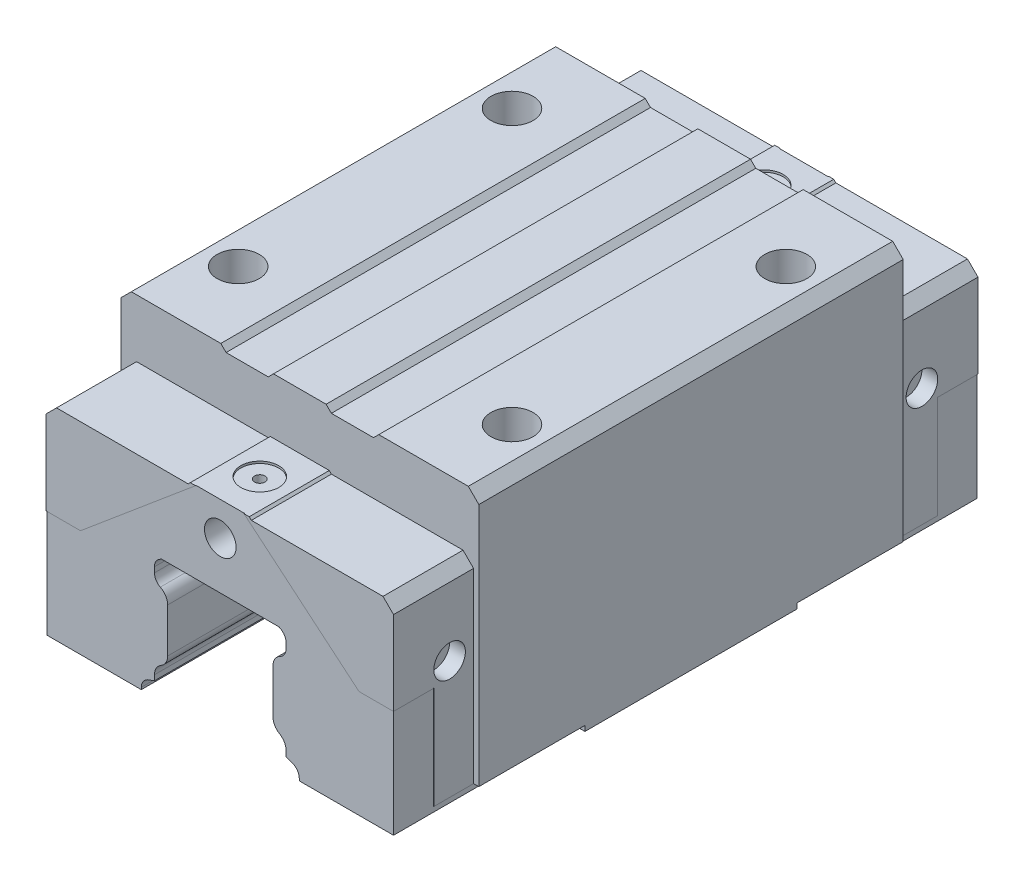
from build123d import *

# Parameters (mm, degrees)
BOSS_EXTRUDE1_DEPTH     = 27.75
CUT_EXTRUDE1_DEPTH      = 7.6
SKETCH8_W               = 6.5
SKETCH8_H               = 1.5
CUT_EXTRUDE5_DEPTH      = 0.05
SKETCH14_W              = 3.775
SKETCH14_H              = 10.233974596
CUT_EXTRUDE6_DEPTH      = 0.05
SKETCH11_R              = 1.5
CUT_EXTRUDE4_DEPTH      = 1.5
MIRROR1_COPY_1_SKETCH_W = 3.775
MIRROR1_COPY_1_SKETCH_H = 10.233974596
MIRROR1_COPY_1_DEPTH    = 0.05
MIRROR1_COPY_2_SKETCH_R = 1.5
MIRROR1_COPY_2_DEPTH    = 1.5
CUT_EXTRUDE2_START      = 10.075
SKETCH10_W              = 0.55
SKETCH10_H              = 0.5
CUT_EXTRUDE2_DEPTH      = 31.780262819
CUT_EXTRUDE3_START      = -10.075
SKETCH10_2_W            = 0.55
SKETCH10_2_H            = 0.5
CUT_EXTRUDE3_DEPTH      = 31.780262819
SKETCH15_W              = 40.3
SKETCH15_H              = 17.7
M_CUT_EXTRUDE7_DEPTH    = 0.5
SKETCH18_R              = 2
M_HOLE_DEPTH            = 7


with BuildPart() as part:
    # Sketch2 → Boss-Extrude1 (new, symmetric)
    with BuildSketch(Plane.XY):
        with BuildLine():
            Line((5.576794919, 11.7), (-5.576794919, 11.7))
            Line((-5.576794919, 11.7), (-5.75, 11.6))
            ThreePointArc((-5.75, 11.6), (-6.116025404, 11.233974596), (-6.25, 10.733974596))
            Line((-6.25, 10.733974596), (-6.25, 10.233974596))
            ThreePointArc((-6.25, 10.233974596), (-6.099836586, 9.70692832), (-5.694444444, 9.33816818))
            ThreePointArc((-5.694444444, 9.33816818), (-5.187704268, 8.877218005), (-5, 8.218410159))
            Line((-5, 8.218410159), (-5, 4.020233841))
            ThreePointArc((-5, 4.020233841), (-5.167468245, 3.395233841), (-5.625, 2.937702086))
            ThreePointArc((-5.625, 2.937702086), (-6.082531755, 2.480170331), (-6.25, 1.855170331))
            Line((-6.25, 1.855170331), (-6.25, 1.355170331))
            Line((-6.25, 1.355170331), (-6.842020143, 1.139692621))
            ThreePointArc((-6.842020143, 1.139692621), (-7.319152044, 0.773576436), (-7.5, 0.2))
            Line((-7.5, 0.2), (-7.5, 0))
            Line((-7.5, 0), (-17, 0))
            Line((-17, 0), (-17, 23.7))
            Line((-17, 23.7), (-16, 24.7))
            Line((-16, 24.7), (-7.5, 24.7))
            Line((-7.5, 24.7), (-7, 24.2))
            Line((-7, 24.2), (-3, 24.2))
            Line((-3, 24.2), (-2.5, 24.7))
            Line((-2.5, 24.7), (2.5, 24.7))
            Line((2.5, 24.7), (3, 24.2))
            Line((3, 24.2), (7, 24.2))
            Line((7, 24.2), (7.5, 24.7))
            Line((7.5, 24.7), (16, 24.7))
            Line((16, 24.7), (17, 23.7))
            Line((17, 23.7), (17, 0))
            Line((17, 0), (7.5, 0))
            Line((7.5, 0), (7.5, 0.2))
            ThreePointArc((7.5, 0.2), (7.319152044, 0.773576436), (6.842020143, 1.139692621))
            Line((6.842020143, 1.139692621), (6.25, 1.355170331))
            Line((6.25, 1.355170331), (6.25, 1.855170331))
            ThreePointArc((6.25, 1.855170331), (6.082531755, 2.480170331), (5.625, 2.937702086))
            ThreePointArc((5.625, 2.937702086), (5.167468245, 3.395233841), (5, 4.020233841))
            Line((5, 4.020233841), (5, 8.218410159))
            ThreePointArc((5, 8.218410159), (5.187704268, 8.877218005), (5.694444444, 9.33816818))
            ThreePointArc((5.694444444, 9.33816818), (6.099836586, 9.70692832), (6.25, 10.233974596))
            Line((6.25, 10.233974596), (6.25, 10.733974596))
            ThreePointArc((6.25, 10.733974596), (6.116025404, 11.233974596), (5.75, 11.6))
            Line((5.75, 11.6), (5.576794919, 11.7))
        make_face()
    extrude(amount=BOSS_EXTRUDE1_DEPTH, both=True)

    # Sketch5 → Cut-Extrude1 (cut)
    with BuildSketch(Plane.XY.offset(27.75)):
        Polygon((16.5, 0), (16.5, 18.2), (15.5, 19.2), (3, 19.2), (2.8, 19.4), (-2.8, 19.4), (-3, 19.2), (-15.5, 19.2), (-16.5, 18.2), (-16.5, 0), (-17, 0), (-17, 23.7), (-16, 24.7), (-7.5, 24.7), (-7, 24.2), (-3, 24.2), (-2.5, 24.7), (2.5, 24.7), (3, 24.2), (7, 24.2), (7.5, 24.7), (16, 24.7), (17, 23.7), (17, 0), align=None)
    cut_extrude1 = extrude(amount=-CUT_EXTRUDE1_DEPTH, mode=Mode.SUBTRACT)

    # Sketch7 → Cut-Revolve1 (revolve, cut)
    with BuildSketch(Plane(origin=(0, 0, 0), x_dir=(0, 0, -1), z_dir=(1, 0, 0))):
        Polygon((-23.95, 19.4), (-22.15, 19.4), (-22.15, 19.2), (-23.45, 19.2), (-23.45, 18.2), (-23.95, 18.2), align=None)
    cut_revolve1 = revolve(axis=Axis((0, 19.4, 23.95), (0, 1, 0)), mode=Mode.SUBTRACT)

    # Sketch8 → J Cut-Revolve2 (revolve, cut)
    with BuildSketch(Plane(origin=(0, 0, 0), x_dir=(0, 0, -1), z_dir=(1, 0, 0))):
        with Locations((-24.5, 16.95)):
            Rectangle(SKETCH8_W, SKETCH8_H)
    j_cut_revolve2 = revolve(axis=Axis((0, 16.2, 27.75), (0, 0, 1)), mode=Mode.SUBTRACT)

    # Sketch13 → Cut-Extrude5 (cut)
    with BuildSketch(Plane.XY.offset(27.75)):
        Polygon((2.3, 19.4), (13.223643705, 10.233974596), (16.5, 10.233974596), (16.5, 0), (-16.5, 0), (-16.5, 10.233974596), (-13.223643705, 10.233974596), (-2.3, 19.4), align=None)
    cut_extrude5 = extrude(amount=-CUT_EXTRUDE5_DEPTH, mode=Mode.SUBTRACT)

    # Sketch14 → Cut-Extrude6 (cut)
    with BuildSketch(Plane(origin=(16.5, 0, 0), x_dir=(0, 0, -1), z_dir=(1, 0, 0))):
        with Locations((-25.8125, 5.116987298)):
            Rectangle(SKETCH14_W, SKETCH14_H)
    cut_extrude6 = extrude(amount=-CUT_EXTRUDE6_DEPTH, mode=Mode.SUBTRACT)

    # Sketch11 → Cut-Extrude4 (cut)
    with BuildSketch(Plane(origin=(16.5, 0, 0), x_dir=(0, 0, -1), z_dir=(1, 0, 0))):
        with Locations((-22.425, 11.733974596)):
            Circle(SKETCH11_R)
    cut_extrude4 = extrude(amount=-CUT_EXTRUDE4_DEPTH, mode=Mode.SUBTRACT)

    # Mirror2: Cut-Extrude6, Cut-Extrude4 across plane
    add(cut_extrude6.mirror(Plane(origin=(0, 0, 0), x_dir=(0, 0, 1), z_dir=(1, 0, 0))), mode=Mode.SUBTRACT)
    add(cut_extrude4.mirror(Plane(origin=(0, 0, 0), x_dir=(0, 0, 1), z_dir=(1, 0, 0))), mode=Mode.SUBTRACT)

    # Mirror1: Cut-Extrude1, Cut-Revolve1, J Cut-Revolve2, Cut-Extrude5, Cut-Extrude6, Cut-Extrude4 across plane
    add(cut_extrude1.mirror(Plane.XY), mode=Mode.SUBTRACT)
    add(cut_revolve1.mirror(Plane.XY), mode=Mode.SUBTRACT)
    add(j_cut_revolve2.mirror(Plane.XY), mode=Mode.SUBTRACT)
    add(cut_extrude5.mirror(Plane.XY), mode=Mode.SUBTRACT)
    add(cut_extrude6.mirror(Plane.XY), mode=Mode.SUBTRACT)
    add(cut_extrude4.mirror(Plane.XY), mode=Mode.SUBTRACT)

    # Mirror1 copy 1 sketch → Mirror1 copy 1 (cut)
    with BuildSketch(Plane.ZY.offset(16.5)):
        with Locations((-25.8125, 5.116987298)):
            Rectangle(MIRROR1_COPY_1_SKETCH_W, MIRROR1_COPY_1_SKETCH_H)
    extrude(amount=-MIRROR1_COPY_1_DEPTH, mode=Mode.SUBTRACT)

    # Mirror1 copy 2 sketch → Mirror1 copy 2 (cut)
    with BuildSketch(Plane.ZY.offset(16.5)):
        with Locations((-22.425, 11.733974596)):
            Circle(MIRROR1_COPY_2_SKETCH_R)
    extrude(amount=-MIRROR1_COPY_2_DEPTH, mode=Mode.SUBTRACT)

    # Sketch10 → Cut-Extrude2 (cut, through all)
    with BuildSketch(Plane.XY.offset(CUT_EXTRUDE2_START)):
        with Locations((16.725, 0.25)):
            Rectangle(SKETCH10_W, SKETCH10_H)
        with Locations((-16.725, 0.25)):
            Rectangle(SKETCH10_W, SKETCH10_H)
    extrude(amount=CUT_EXTRUDE2_DEPTH, mode=Mode.SUBTRACT)

    # Sketch10_2 → Cut-Extrude3 (cut, through all)
    with BuildSketch(Plane.XY.offset(CUT_EXTRUDE3_START)):
        with Locations((16.725, 0.25)):
            Rectangle(SKETCH10_2_W, SKETCH10_2_H)
        with Locations((-16.725, 0.25)):
            Rectangle(SKETCH10_2_W, SKETCH10_2_H)
    extrude(amount=-CUT_EXTRUDE3_DEPTH, mode=Mode.SUBTRACT)

    # Sketch15 → M Cut-Extrude7 (cut)
    with BuildSketch(Plane.ZY.offset(17)):
        with Locations((0, 8.85)):
            Rectangle(SKETCH15_W, SKETCH15_H)
    extrude(amount=-M_CUT_EXTRUDE7_DEPTH, mode=Mode.SUBTRACT)

    # Sketch18 → M HOLE (cut)
    with BuildSketch(Plane(origin=(0, 24.7, 0), x_dir=(1, 0, 0), z_dir=(0, 1, 0))):
        with Locations(Location((13, -13, 0), (0, 0, 270))):
            Circle(SKETCH18_R)
        with Locations(Location((-13, -13, 0), (0, 0, 270))):
            Circle(SKETCH18_R)
    m_hole = extrude(amount=-M_HOLE_DEPTH, mode=Mode.SUBTRACT)

    # Mirror3: M HOLE across plane
    add(m_hole.mirror(Plane.XY), mode=Mode.SUBTRACT)


solid = part.part
